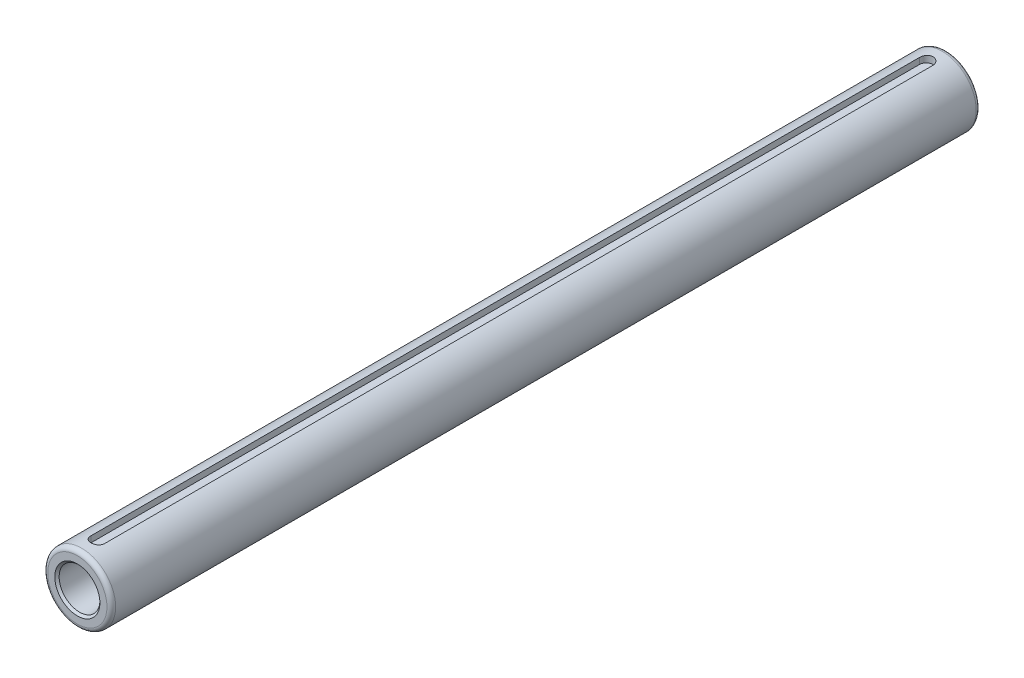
from build123d import *

# Parameters (mm, degrees)
SKETCH1_R           = 15.875
SKETCH1_R_2         = 9.525
BOSS_EXTRUDE1_DEPTH = 203.2
CUT_EXTRUDE1_START  = 12.7
CUT_EXTRUDE1_DEPTH  = 12.7
FILLET1_R           = 2.032
CHAMFER1_SIZE       = 1.016


with BuildPart() as part:
    # Sketch1 → Boss-Extrude1 (new, symmetric)
    with BuildSketch(Plane.XY):
        Circle(SKETCH1_R)
        Circle(SKETCH1_R_2, mode=Mode.SUBTRACT)
    extrude(amount=BOSS_EXTRUDE1_DEPTH, both=True)

    # Sketch2 → Cut-Extrude1 (cut)
    with BuildSketch(Plane(origin=(0, 0, 0), x_dir=(1, 0, 0), z_dir=(0, 1, 0)).offset(CUT_EXTRUDE1_START)):
        with BuildLine():
            Line((-3.175, -193.675), (-3.175, 193.675))
            ThreePointArc((-3.175, 193.675), (0, 196.85), (3.175, 193.675))
            Line((3.175, 193.675), (3.175, -193.675))
            ThreePointArc((3.175, -193.675), (0, -196.85), (-3.175, -193.675))
        make_face()
    extrude(amount=CUT_EXTRUDE1_DEPTH, mode=Mode.SUBTRACT)

    # Fillet1
    fillet1_edges = [part.edges().sort_by_distance(p)[0] for p in [
        (-15.875, 0, -203.2),
        (-15.875, 0, 203.2),
    ]]
    fillet(fillet1_edges, radius=FILLET1_R)

    # Chamfer1
    chamfer1_edges = [part.edges().sort_by_distance(p)[0] for p in [
        (-9.525, 0, -203.2),
        (-9.525, 0, 203.2),
    ]]
    chamfer(chamfer1_edges, length=CHAMFER1_SIZE)


solid = part.part
